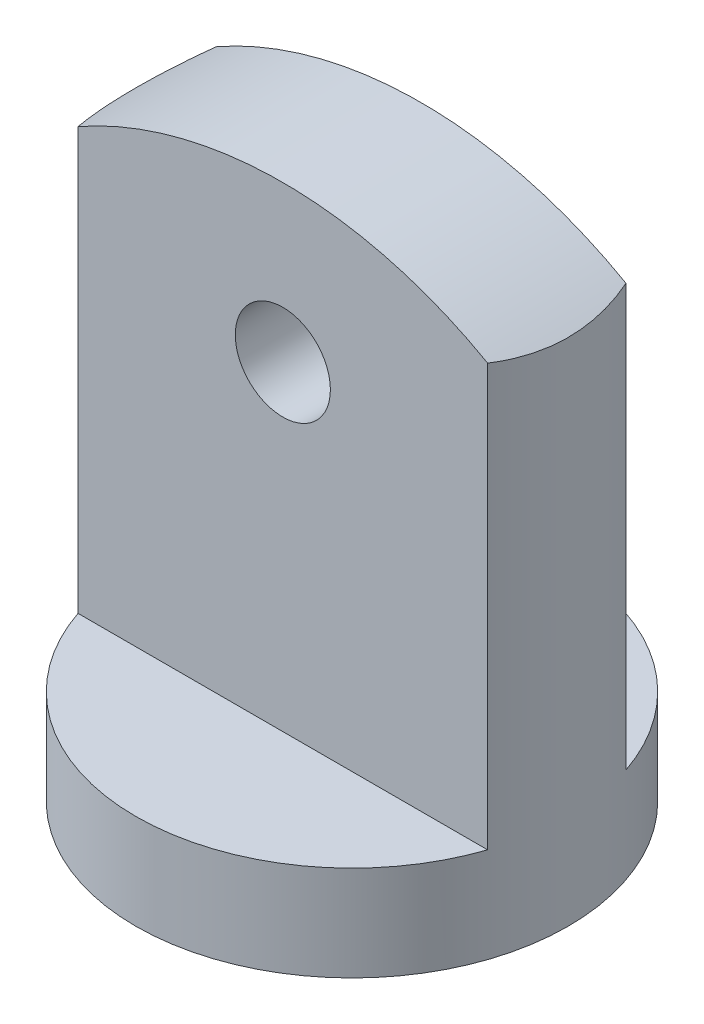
from build123d import *

# Parameters (mm, degrees)
SKETCH1_R               = 2.5
BOSS_EXTRUDE1_DEPTH     = 1.1
SKETCH3_W               = 5
SKETCH3_H               = 5.5
BOSS_EXTRUDE2_DEPTH     = 0.8
CUT_EXTRUDE1_DEPTH      = 8.791020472
CUT_EXTRUDE1_DEPTH_BACK = 8.791020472
SKETCH5_R               = 0.55
CUT_EXTRUDE2_DEPTH      = 1.6
SKETCH6_R               = 2.75
SKETCH6_R_2             = 2.5
CUT_EXTRUDE4_DEPTH      = 5.6
SKETCH7_R               = 1
CUT_EXTRUDE5_DEPTH      = 1


with BuildPart() as part:
    # Sketch1 → Boss-Extrude1 (new body)
    with BuildSketch(Plane(origin=(0, 0, 0), x_dir=(1, 0, 0), z_dir=(0, 1, 0))):
        with Locations(Location((0, 0, 0), (0, 0, 270))):
            Circle(SKETCH1_R)
    extrude(amount=BOSS_EXTRUDE1_DEPTH)

    # Sketch3 → Boss-Extrude2 (add, symmetric)
    with BuildSketch(Plane.XY):
        with Locations((0, 3.85)):
            Rectangle(SKETCH3_W, SKETCH3_H)
    extrude(amount=BOSS_EXTRUDE2_DEPTH, both=True)

    # Sketch4 → Cut-Extrude1 (cut, two sides: drawn at the far end of the back side and taken through both)
    with BuildSketch(Plane.XY.offset(0.8).offset(-CUT_EXTRUDE1_DEPTH_BACK)):
        with BuildLine():
            Line((-24.237269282, -7.364764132), (-2.5, 5.89756025))
            ThreePointArc((-2.5, 5.89756025), (0, 6.6), (2.5, 5.89756025))
            Line((2.5, 5.89756025), (24.237269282, -7.364764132))
            Line((24.237269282, -7.364764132), (24.237269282, 43.562561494))
            Line((24.237269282, 43.562561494), (-24.237269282, 43.562561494))
            Line((-24.237269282, 43.562561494), (-24.237269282, -7.364764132))
        make_face()
    extrude(amount=CUT_EXTRUDE1_DEPTH + CUT_EXTRUDE1_DEPTH_BACK, mode=Mode.SUBTRACT)

    # Sketch5 → Cut-Extrude2 (cut)
    with BuildSketch(Plane.XY.offset(0.8)):
        with Locations((0, 4.8)):
            Circle(SKETCH5_R)
    extrude(amount=-CUT_EXTRUDE2_DEPTH, mode=Mode.SUBTRACT)

    # Sketch6 → Cut-Extrude4 (cut)
    with BuildSketch(Plane(origin=(0, 1.1, 0), x_dir=(1, 0, 0), z_dir=(0, 1, 0))):
        Circle(SKETCH6_R)
        with Locations(Location((0, 0, 0), (0, 0, 161.337075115))):
            Circle(SKETCH6_R_2, mode=Mode.SUBTRACT)
    extrude(amount=CUT_EXTRUDE4_DEPTH, mode=Mode.SUBTRACT)

    # Sketch7 → Cut-Extrude5 (cut)
    with BuildSketch(Plane.XZ):
        with Locations(Location((0, 0, 0), (0, 0, 270))):
            Circle(SKETCH7_R)
    extrude(amount=-CUT_EXTRUDE5_DEPTH, mode=Mode.SUBTRACT)


solid = part.part
